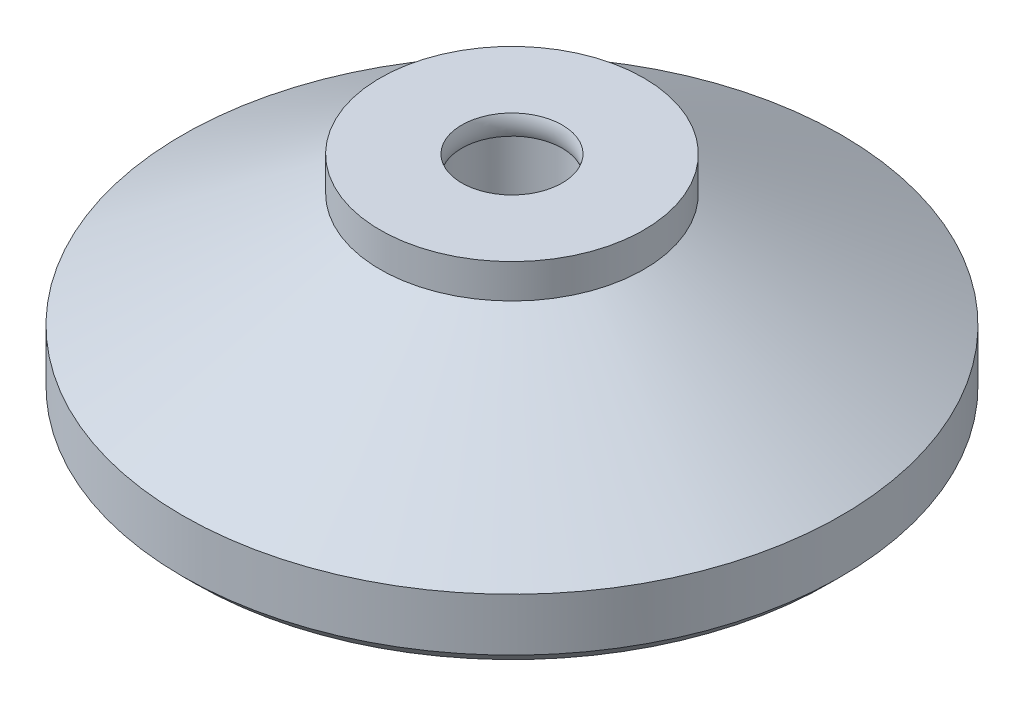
from build123d import *

# Parameters (mm, degrees)
SKETCH1_R      = 8
EXTRUDE1_DEPTH = 6.5
SKETCH3_R      = 20
EXTRUDE2_DEPTH = 4
CHAMFER1_SIZE  = 0.8


with BuildPart() as part:
    # Sketch1 → Extrude1 (new, symmetric)
    with BuildSketch(Plane(origin=(0, 0, 0), x_dir=(1, 0, 0), z_dir=(0, 1, 0))):
        with Locations(Location((0, 0, 0), (0, 0, 90))):
            Circle(SKETCH1_R)
    extrude(amount=EXTRUDE1_DEPTH, both=True)

    # Sketch3 → Extrude2 (add)
    with BuildSketch(Plane.XZ.offset(6.5)):
        with Locations(Location((0, 0, 0), (0, 0, 270))):
            Circle(SKETCH3_R)
    extrude(amount=-EXTRUDE2_DEPTH)

    # Sketch4 → Revolve1 (revolve)
    with BuildSketch(Plane.XY, mode=Mode.PRIVATE) as revolve1_sk:
        Polygon((-20, -2.5), (-8, 4.42820323), (-8, -2.5), align=None)
    revolve(revolve1_sk.sketch.rotate(Axis((0, 6.5, 0), (0, -1, 0)), 90), axis=Axis((0, 6.5, 0), (0, -1, 0)))

    # Chamfer1
    chamfer1_edges = [part.edges().sort_by_distance(p)[0] for p in [
        (0, -6.5, 20),
    ]]
    chamfer(chamfer1_edges, length=CHAMFER1_SIZE)

    # Sketch5 → Cut-Revolve1 (revolve, cut)
    with BuildSketch(Plane.XY, mode=Mode.PRIVATE) as cut_revolve1_sk:
        with BuildLine():
            Line((0, 6.5), (3.05, 6.5))
            ThreePointArc((3.05, 6.5), (2.928, 5.89), (3.05, 5.28))
            Line((3.05, 5.28), (3.05, -0.739081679))
            Line((3.05, -0.739081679), (0, -2.5))
            Line((0, -2.5), (0, 6.5))
        make_face()
    revolve(cut_revolve1_sk.sketch.rotate(Axis((0, 0, 0), (0, 1, 0)), 270), axis=Axis((0, 0, 0), (0, 1, 0)), mode=Mode.SUBTRACT)


solid = part.part
